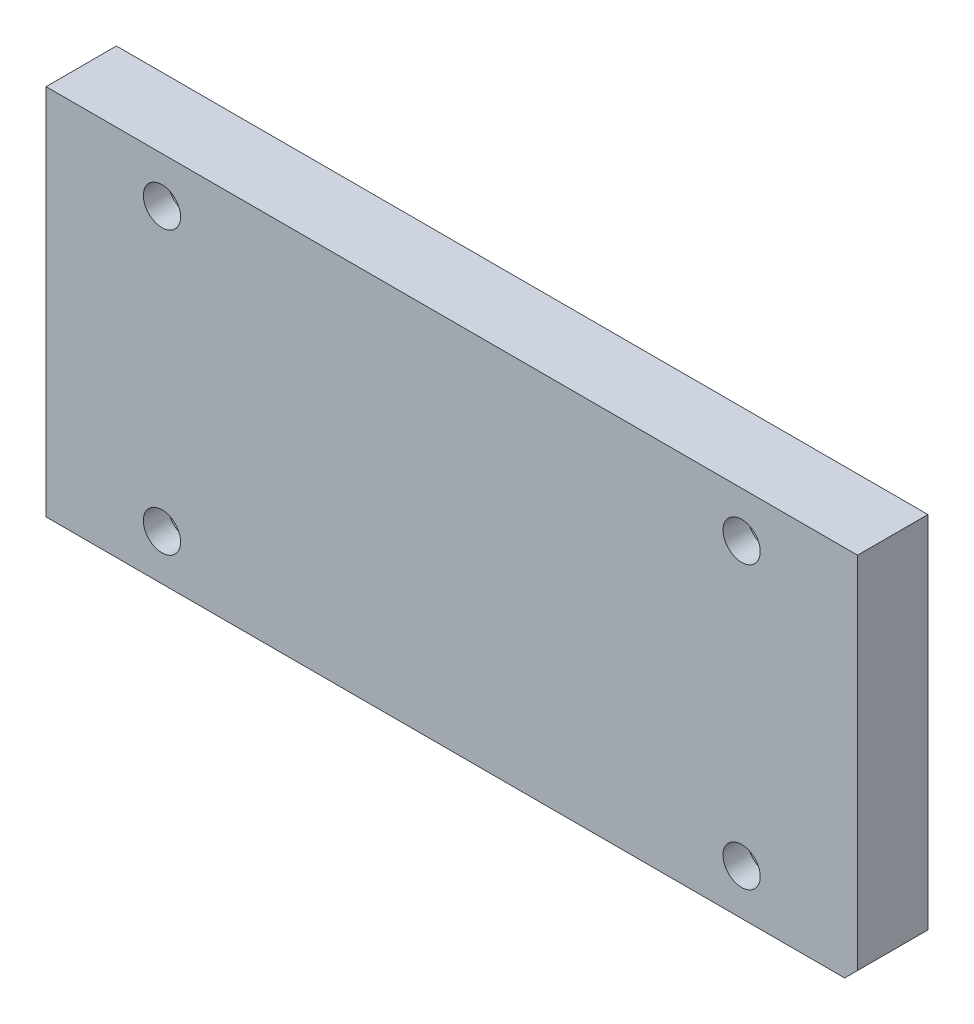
from build123d import *

# Parameters (mm, degrees)
SKETCH1_W                = 196
SKETCH1_H                = 90
BOSS_EXTRUDE1_DEPTH      = 17
HOLE1_D                  = 9
HOLE1_CBORE_D            = 15
HOLE1_CBORE_DEPTH        = 11
TAPPED_HOLE1_D           = 3.3
TAPPED_HOLE1_DEPTH       = 11.008579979
TAPPED_HOLE1_CBORE_D     = 4
TAPPED_HOLE1_CBORE_DEPTH = 7
TAPPED_HOLE1_TIP         = 0.991420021
CHAMFER1_SIZE            = 3.12


with BuildPart() as part:
    # Sketch1 → Boss-Extrude1 (new body)
    with BuildSketch(Plane.XY):
        Rectangle(SKETCH1_W, SKETCH1_H)
    extrude(amount=-BOSS_EXTRUDE1_DEPTH)

    # Hole1 (through all)
    with Locations(Plane(origin=(0, 0, -17), x_dir=(1, 0, 0), z_dir=(0, 0, -1))):
        with Locations((70, -34), (70, 34), (-70, 34), (-70, -34)):
            CounterBoreHole(HOLE1_D / 2, HOLE1_CBORE_D / 2, HOLE1_CBORE_DEPTH)

    # Tapped Hole1
    with Locations(Plane(origin=(522.991452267, 0, -17), x_dir=(-1, 0, 0), z_dir=(0, 0, -1))):
        with Locations((436.991452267, 34), (436.991452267, -34), (608.991452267, -34), (608.991452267, 34)):
            CounterBoreHole(TAPPED_HOLE1_D / 2, TAPPED_HOLE1_CBORE_D / 2, TAPPED_HOLE1_CBORE_DEPTH, depth=TAPPED_HOLE1_DEPTH)
            with Locations((0, 0, -(TAPPED_HOLE1_DEPTH + TAPPED_HOLE1_TIP / 2))):  # 118° drill point
                Cone(0, TAPPED_HOLE1_D / 2, TAPPED_HOLE1_TIP, mode=Mode.SUBTRACT)

    # Chamfer1
    chamfer1_edges = [part.edges().sort_by_distance(p)[0] for p in [
        (98, -45, -8.5),
    ]]
    chamfer(chamfer1_edges, length=CHAMFER1_SIZE)


solid = part.part
